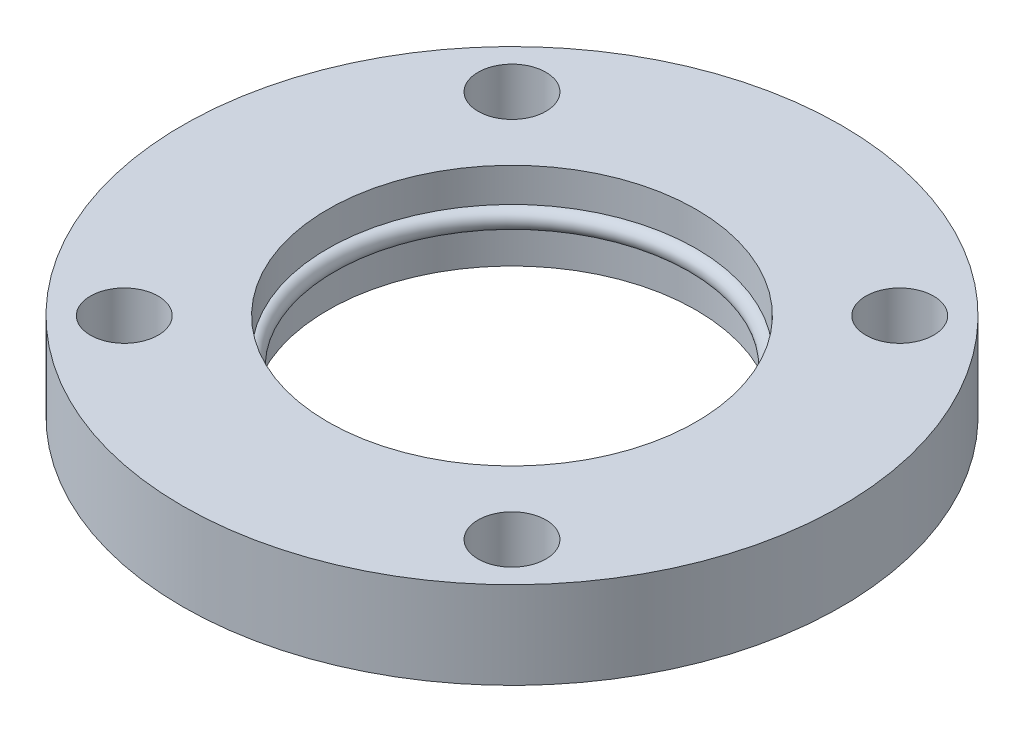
from build123d import *

# Parameters (mm, degrees)
SKETCH2_R           = 34
SKETCH2_R_2         = 19
SKETCH2_R_3         = 3.5
BOSS_EXTRUDE1_DEPTH = 4.5
SKETCH3_R           = 1


with BuildPart() as part:
    # Sketch2 → Boss-Extrude1 (new, symmetric)
    with BuildSketch(Plane(origin=(0, 0, 0), x_dir=(1, 0, 0), z_dir=(0, 1, 0))):
        with Locations(Location((0, 0, 0), (0, 0, 270))):
            Circle(SKETCH2_R)
        with Locations(Location((0, 0, 0), (0, 0, 270))):
            Circle(SKETCH2_R_2, mode=Mode.SUBTRACT)
        with Locations(Location((-20, 20, 0), (0, 0, 270))):
            Circle(SKETCH2_R_3, mode=Mode.SUBTRACT)
        with Locations(Location((20, 20, 0), (0, 0, 270))):
            Circle(SKETCH2_R_3, mode=Mode.SUBTRACT)
        with Locations(Location((20, -20, 0), (0, 0, 270))):
            Circle(SKETCH2_R_3, mode=Mode.SUBTRACT)
        with Locations(Location((-20, -20, 0), (0, 0, 270))):
            Circle(SKETCH2_R_3, mode=Mode.SUBTRACT)
    extrude(amount=BOSS_EXTRUDE1_DEPTH, both=True)

    # Sketch3 → Revolve2 (revolve)
    with BuildSketch(Plane.XY, mode=Mode.PRIVATE) as revolve2_sk:
        with Locations((-19, 0)):
            Circle(SKETCH3_R)
    revolve(revolve2_sk.sketch.rotate(Axis((0, 0, 0), (0, 1, 0)), 270), axis=Axis((0, 0, 0), (0, 1, 0)))


solid = part.part
